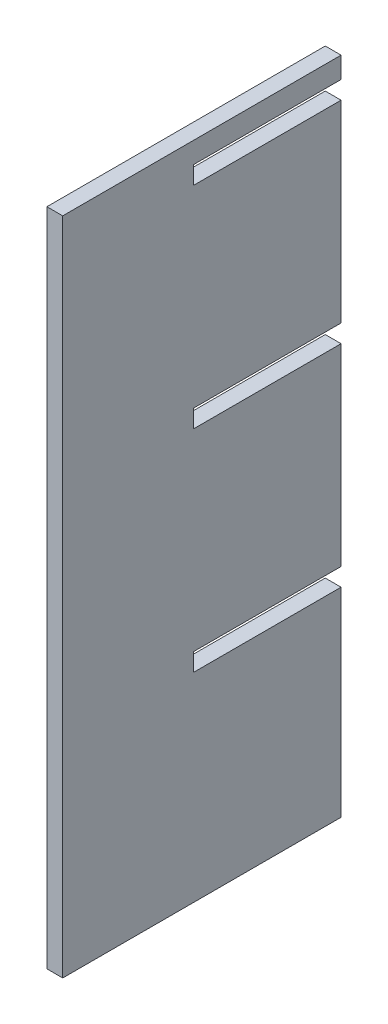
from build123d import *

# Parameters (mm, degrees)
CROQUIS16_W             = 1.5
CROQUIS16_H             = 79.5
SALIENTE_EXTRUIR9_DEPTH = 26.4
CROQUIS20_W             = 14
CROQUIS20_H             = 1.7
CORTAR_EXTRUIR2_DEPTH   = 1.5
CROQUIS21_W             = 26.4
CROQUIS21_H             = 16.9
CORTAR_EXTRUIR3_DEPTH   = 1.5


with BuildPart() as part:
    # Croquis16 → Saliente-Extruir9 (new body)
    with BuildSketch(Plane.XY):
        with Locations((-17.5, 0)):
            Rectangle(CROQUIS16_W, CROQUIS16_H)
    extrude(amount=SALIENTE_EXTRUIR9_DEPTH)

    # Croquis20 → Cortar-Extruir2 (cut)
    with BuildSketch(Plane(origin=(-16.75, 0, 0), x_dir=(0, 0, -1), z_dir=(1, 0, 0))):
        with Locations((-7, -20)):
            Rectangle(CROQUIS20_W, CROQUIS20_H)
        with Locations((-7, 0)):
            Rectangle(CROQUIS20_W, CROQUIS20_H)
        with Locations((-7, 20)):
            Rectangle(CROQUIS20_W, CROQUIS20_H)
    extrude(amount=-CORTAR_EXTRUIR2_DEPTH, mode=Mode.SUBTRACT)

    # Croquis21 → Cortar-Extruir3 (cut)
    with BuildSketch(Plane(origin=(-16.75, 0, 0), x_dir=(0, 0, -1), z_dir=(1, 0, 0))):
        with Locations((-13.2, 31.3)):
            Rectangle(CROQUIS21_W, CROQUIS21_H)
    extrude(amount=-CORTAR_EXTRUIR3_DEPTH, mode=Mode.SUBTRACT)


solid = part.part
